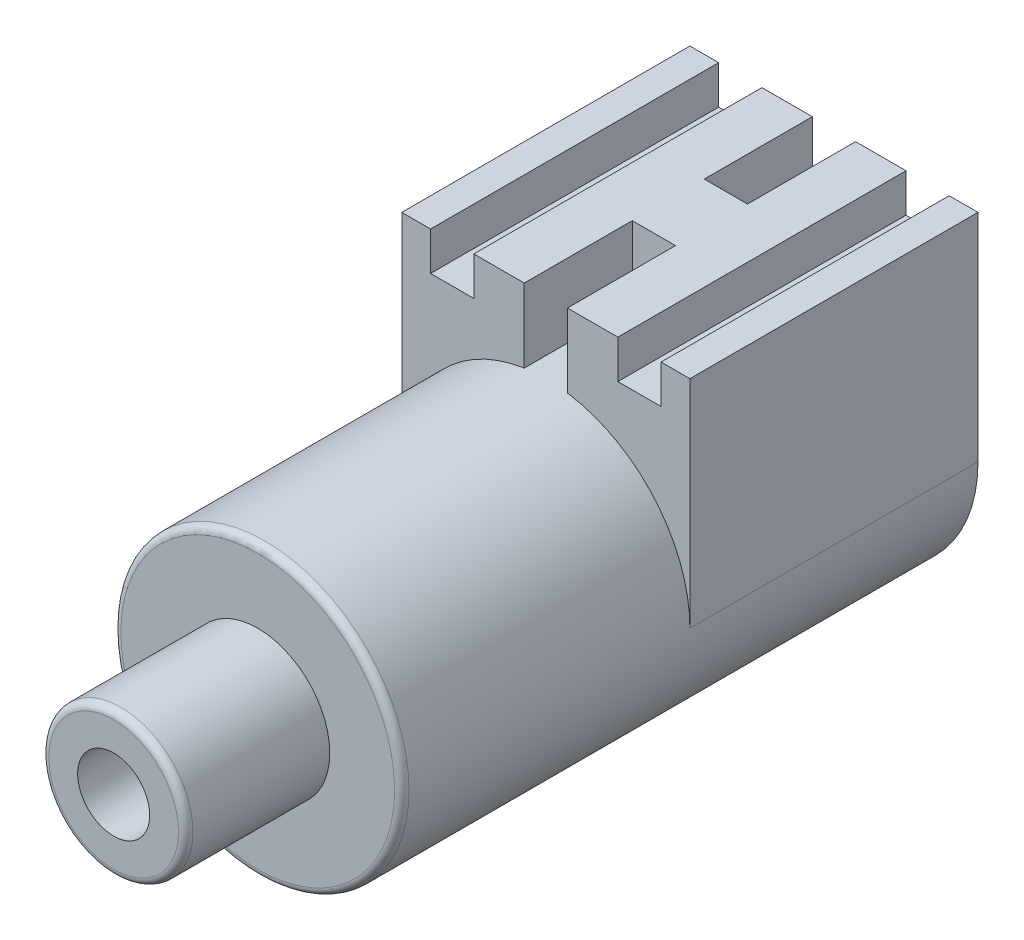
ISO-10303-21;
HEADER;
FILE_DESCRIPTION(('STEP AP214'),'2;1');
FILE_NAME('part.step','',(''),(''),'','','');
FILE_SCHEMA(('AUTOMOTIVE_DESIGN { 1 0 10303 214 1 1 1 1 }'));
ENDSEC;
DATA;
#1=APPLICATION_CONTEXT('core data for automotive mechanical design processes');
#2=APPLICATION_PROTOCOL_DEFINITION('international standard','automotive_design',2000,#1);
#3=PRODUCT_CONTEXT('',#1,'mechanical');
#4=PRODUCT('Part','Part','',(#3));
#5=PRODUCT_RELATED_PRODUCT_CATEGORY('part','',(#4));
#6=PRODUCT_DEFINITION_FORMATION('','',#4);
#7=PRODUCT_DEFINITION_CONTEXT('part definition',#1,'design');
#8=PRODUCT_DEFINITION('design','',#6,#7);
#9=PRODUCT_DEFINITION_SHAPE('','',#8);
#10=(LENGTH_UNIT() NAMED_UNIT(*) SI_UNIT(.MILLI.,.METRE.));
#11=(NAMED_UNIT(*) PLANE_ANGLE_UNIT() SI_UNIT($,.RADIAN.));
#12=(NAMED_UNIT(*) SI_UNIT($,.STERADIAN.) SOLID_ANGLE_UNIT());
#13=UNCERTAINTY_MEASURE_WITH_UNIT(LENGTH_MEASURE(1.E-05),#10,'distance_accuracy_value','');
#14=(GEOMETRIC_REPRESENTATION_CONTEXT(3) GLOBAL_UNCERTAINTY_ASSIGNED_CONTEXT((#13)) GLOBAL_UNIT_ASSIGNED_CONTEXT((#10,
#11,#12)) REPRESENTATION_CONTEXT('',''));
#15=CARTESIAN_POINT('',(0.,0.,0.));
#16=DIRECTION('',(0.,0.,1.));
#17=DIRECTION('',(1.,0.,0.));
#18=AXIS2_PLACEMENT_3D('',#15,#16,#17);
#19=CARTESIAN_POINT('',(0.,0.,-6.));
#20=DIRECTION('',(0.,0.,-1.));
#21=DIRECTION('',(-1.,0.,0.));
#22=AXIS2_PLACEMENT_3D('',#19,#20,#21);
#23=PLANE('',#22);
#24=CARTESIAN_POINT('',(0.,0.,-6.));
#25=DIRECTION('',(0.,0.,-1.));
#26=DIRECTION('',(-1.,0.,0.));
#27=AXIS2_PLACEMENT_3D('',#24,#25,#26);
#28=CIRCLE('',#27,2.);
#29=CARTESIAN_POINT('',(-2.,0.,-6.));
#30=VERTEX_POINT('',#29);
#31=CARTESIAN_POINT('',(-0.3,1.97737199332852,-6.));
#32=VERTEX_POINT('',#31);
#33=EDGE_CURVE('E192',#30,#32,#28,.T.);
#34=ORIENTED_EDGE('',*,*,#33,.T.);
#35=DIRECTION('',(0.,-1.,0.));
#36=VECTOR('',#35,1.);
#37=CARTESIAN_POINT('',(-0.3,3.,-6.));
#38=LINE('',#37,#36);
#39=CARTESIAN_POINT('',(-0.3,3.,-6.));
#40=VERTEX_POINT('',#39);
#41=EDGE_CURVE('E42',#40,#32,#38,.T.);
#42=ORIENTED_EDGE('',*,*,#41,.F.);
#43=DIRECTION('',(1.,0.,0.));
#44=VECTOR('',#43,1.);
#45=CARTESIAN_POINT('',(2.,3.,-6.));
#46=LINE('',#45,#44);
#47=CARTESIAN_POINT('',(-1.,3.,-6.));
#48=VERTEX_POINT('',#47);
#49=EDGE_CURVE('E362',#48,#40,#46,.T.);
#50=ORIENTED_EDGE('',*,*,#49,.F.);
#51=DIRECTION('',(0.,-1.,0.));
#52=VECTOR('',#51,1.);
#53=CARTESIAN_POINT('',(-1.,0.,-6.));
#54=LINE('',#53,#52);
#55=CARTESIAN_POINT('',(-1.,2.46520049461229,-6.));
#56=VERTEX_POINT('',#55);
#57=EDGE_CURVE('E244',#48,#56,#54,.T.);
#58=ORIENTED_EDGE('',*,*,#57,.T.);
#59=DIRECTION('',(-1.,0.,0.));
#60=VECTOR('',#59,1.);
#61=CARTESIAN_POINT('',(0.,2.46520049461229,-6.));
#62=LINE('',#61,#60);
#63=CARTESIAN_POINT('',(-1.6,2.46520049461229,-6.));
#64=VERTEX_POINT('',#63);
#65=EDGE_CURVE('E11',#56,#64,#62,.T.);
#66=ORIENTED_EDGE('',*,*,#65,.T.);
#67=DIRECTION('',(0.,1.,0.));
#68=VECTOR('',#67,1.);
#69=CARTESIAN_POINT('',(-1.6,0.,-6.));
#70=LINE('',#69,#68);
#71=CARTESIAN_POINT('',(-1.6,3.,-6.));
#72=VERTEX_POINT('',#71);
#73=EDGE_CURVE('E299',#64,#72,#70,.T.);
#74=ORIENTED_EDGE('',*,*,#73,.T.);
#75=CARTESIAN_POINT('',(-2.,3.,-6.));
#76=VERTEX_POINT('',#75);
#77=EDGE_CURVE('E357',#76,#72,#46,.T.);
#78=ORIENTED_EDGE('',*,*,#77,.F.);
#79=DIRECTION('',(0.,1.,0.));
#80=VECTOR('',#79,1.);
#81=CARTESIAN_POINT('',(-2.,3.,-6.));
#82=LINE('',#81,#80);
#83=EDGE_CURVE('E355',#30,#76,#82,.T.);
#84=ORIENTED_EDGE('',*,*,#83,.F.);
#85=EDGE_LOOP('',(#34,#42,#50,#58,#66,#74,#78,#84));
#86=FACE_BOUND('',#85,.T.);
#87=ADVANCED_FACE('F27',(#86),#23,.F.);
#88=CARTESIAN_POINT('',(2.,3.,-6.));
#89=DIRECTION('',(0.,1.,0.));
#90=DIRECTION('',(0.,0.,1.));
#91=AXIS2_PLACEMENT_3D('',#88,#89,#90);
#92=PLANE('',#91);
#93=DIRECTION('',(0.,0.,1.));
#94=VECTOR('',#93,1.);
#95=CARTESIAN_POINT('',(-0.3,3.,-7.5));
#96=LINE('',#95,#94);
#97=CARTESIAN_POINT('',(-0.3,3.,-7.5));
#98=VERTEX_POINT('',#97);
#99=EDGE_CURVE('E333',#98,#40,#96,.T.);
#100=ORIENTED_EDGE('',*,*,#99,.F.);
#101=DIRECTION('',(-1.,0.,0.));
#102=VECTOR('',#101,1.);
#103=CARTESIAN_POINT('',(-0.3,3.,-7.5));
#104=LINE('',#103,#102);
#105=CARTESIAN_POINT('',(0.3,3.,-7.5));
#106=VERTEX_POINT('',#105);
#107=EDGE_CURVE('E334',#106,#98,#104,.T.);
#108=ORIENTED_EDGE('',*,*,#107,.F.);
#109=DIRECTION('',(0.,0.,1.));
#110=VECTOR('',#109,1.);
#111=CARTESIAN_POINT('',(0.3,3.,-7.5));
#112=LINE('',#111,#110);
#113=CARTESIAN_POINT('',(0.3,3.,-6.));
#114=VERTEX_POINT('',#113);
#115=EDGE_CURVE('E174',#106,#114,#112,.T.);
#116=ORIENTED_EDGE('',*,*,#115,.T.);
#117=CARTESIAN_POINT('',(1.,3.,-6.));
#118=VERTEX_POINT('',#117);
#119=EDGE_CURVE('E184',#114,#118,#46,.T.);
#120=ORIENTED_EDGE('',*,*,#119,.T.);
#121=DIRECTION('',(0.,0.,1.));
#122=VECTOR('',#121,1.);
#123=CARTESIAN_POINT('',(1.,3.,-6.));
#124=LINE('',#123,#122);
#125=CARTESIAN_POINT('',(1.,3.,-10.));
#126=VERTEX_POINT('',#125);
#127=EDGE_CURVE('E226',#126,#118,#124,.T.);
#128=ORIENTED_EDGE('',*,*,#127,.F.);
#129=DIRECTION('',(1.,0.,0.));
#130=VECTOR('',#129,1.);
#131=CARTESIAN_POINT('',(2.,3.,-10.));
#132=LINE('',#131,#130);
#133=CARTESIAN_POINT('',(0.3,3.,-10.));
#134=VERTEX_POINT('',#133);
#135=EDGE_CURVE('E265',#134,#126,#132,.T.);
#136=ORIENTED_EDGE('',*,*,#135,.F.);
#137=DIRECTION('',(0.,0.,-1.));
#138=VECTOR('',#137,1.);
#139=CARTESIAN_POINT('',(0.3,3.,-8.5));
#140=LINE('',#139,#138);
#141=CARTESIAN_POINT('',(0.3,3.,-8.5));
#142=VERTEX_POINT('',#141);
#143=EDGE_CURVE('E257',#142,#134,#140,.T.);
#144=ORIENTED_EDGE('',*,*,#143,.F.);
#145=DIRECTION('',(1.,0.,0.));
#146=VECTOR('',#145,1.);
#147=CARTESIAN_POINT('',(0.3,3.,-8.5));
#148=LINE('',#147,#146);
#149=CARTESIAN_POINT('',(-0.3,3.,-8.5));
#150=VERTEX_POINT('',#149);
#151=EDGE_CURVE('E312',#150,#142,#148,.T.);
#152=ORIENTED_EDGE('',*,*,#151,.F.);
#153=DIRECTION('',(0.,0.,-1.));
#154=VECTOR('',#153,1.);
#155=CARTESIAN_POINT('',(-0.3,3.,-8.5));
#156=LINE('',#155,#154);
#157=CARTESIAN_POINT('',(-0.3,3.,-10.));
#158=VERTEX_POINT('',#157);
#159=EDGE_CURVE('E263',#150,#158,#156,.T.);
#160=ORIENTED_EDGE('',*,*,#159,.T.);
#161=CARTESIAN_POINT('',(-1.,3.,-10.));
#162=VERTEX_POINT('',#161);
#163=EDGE_CURVE('E253',#162,#158,#132,.T.);
#164=ORIENTED_EDGE('',*,*,#163,.F.);
#165=DIRECTION('',(0.,0.,-1.));
#166=VECTOR('',#165,1.);
#167=CARTESIAN_POINT('',(-1.,3.,-6.));
#168=LINE('',#167,#166);
#169=EDGE_CURVE('E35',#48,#162,#168,.T.);
#170=ORIENTED_EDGE('',*,*,#169,.F.);
#171=ORIENTED_EDGE('',*,*,#49,.T.);
#172=EDGE_LOOP('',(#100,#108,#116,#120,#128,#136,#144,#152,#160,#164,#170,#171));
#173=FACE_BOUND('',#172,.T.);
#174=ADVANCED_FACE('F261',(#173),#92,.T.);
#175=DIRECTION('',(0.,0.,-1.));
#176=VECTOR('',#175,1.);
#177=CARTESIAN_POINT('',(1.6,3.,-6.));
#178=LINE('',#177,#176);
#179=CARTESIAN_POINT('',(1.6,3.,-6.));
#180=VERTEX_POINT('',#179);
#181=CARTESIAN_POINT('',(1.6,3.,-10.));
#182=VERTEX_POINT('',#181);
#183=EDGE_CURVE('E229',#180,#182,#178,.T.);
#184=ORIENTED_EDGE('',*,*,#183,.F.);
#185=CARTESIAN_POINT('',(2.,3.,-6.));
#186=VERTEX_POINT('',#185);
#187=EDGE_CURVE('E359',#180,#186,#46,.T.);
#188=ORIENTED_EDGE('',*,*,#187,.T.);
#189=DIRECTION('',(0.,0.,-1.));
#190=VECTOR('',#189,1.);
#191=CARTESIAN_POINT('',(2.,3.,-6.));
#192=LINE('',#191,#190);
#193=CARTESIAN_POINT('',(2.,3.,-10.));
#194=VERTEX_POINT('',#193);
#195=EDGE_CURVE('E193',#186,#194,#192,.T.);
#196=ORIENTED_EDGE('',*,*,#195,.T.);
#197=EDGE_CURVE('E267',#182,#194,#132,.T.);
#198=ORIENTED_EDGE('',*,*,#197,.F.);
#199=EDGE_LOOP('',(#184,#188,#196,#198));
#200=FACE_BOUND('',#199,.T.);
#201=ADVANCED_FACE('F372',(#200),#92,.T.);
#202=CARTESIAN_POINT('',(0.,0.,-10.));
#203=DIRECTION('',(0.,0.,1.));
#204=DIRECTION('',(1.,0.,0.));
#205=AXIS2_PLACEMENT_3D('',#202,#203,#204);
#206=CYLINDRICAL_SURFACE('',#205,0.5);
#207=CARTESIAN_POINT('',(0.,0.,0.));
#208=DIRECTION('',(0.,0.,1.));
#209=DIRECTION('',(1.,0.,0.));
#210=AXIS2_PLACEMENT_3D('',#207,#208,#209);
#211=CIRCLE('',#210,0.5);
#212=CARTESIAN_POINT('',(0.5,0.,0.));
#213=VERTEX_POINT('',#212);
#214=EDGE_CURVE('E196',#213,#213,#211,.T.);
#215=ORIENTED_EDGE('',*,*,#214,.T.);
#216=EDGE_LOOP('',(#215));
#217=FACE_BOUND('',#216,.T.);
#218=CARTESIAN_POINT('',(0.,0.,-6.));
#219=DIRECTION('',(0.,0.,-1.));
#220=DIRECTION('',(-1.,0.,0.));
#221=AXIS2_PLACEMENT_3D('',#218,#219,#220);
#222=CIRCLE('',#221,0.5);
#223=CARTESIAN_POINT('',(-0.5,0.,-6.));
#224=VERTEX_POINT('',#223);
#225=EDGE_CURVE('E211',#224,#224,#222,.F.);
#226=ORIENTED_EDGE('',*,*,#225,.F.);
#227=EDGE_LOOP('',(#226));
#228=FACE_BOUND('',#227,.T.);
#229=ADVANCED_FACE('F427',(#217,#228),#206,.F.);
#230=CARTESIAN_POINT('',(0.,0.,-2.));
#231=DIRECTION('',(0.,0.,1.));
#232=DIRECTION('',(1.,0.,0.));
#233=AXIS2_PLACEMENT_3D('',#230,#231,#232);
#234=CYLINDRICAL_SURFACE('',#233,1.);
#235=CARTESIAN_POINT('',(0.,0.,-0.1));
#236=DIRECTION('',(0.,0.,1.));
#237=DIRECTION('',(1.,0.,0.));
#238=AXIS2_PLACEMENT_3D('',#235,#236,#237);
#239=CIRCLE('',#238,1.);
#240=CARTESIAN_POINT('',(1.,0.,-0.1));
#241=VERTEX_POINT('',#240);
#242=EDGE_CURVE('E223',#241,#241,#239,.F.);
#243=ORIENTED_EDGE('',*,*,#242,.T.);
#244=EDGE_LOOP('',(#243));
#245=FACE_BOUND('',#244,.T.);
#246=CARTESIAN_POINT('',(0.,0.,-2.));
#247=DIRECTION('',(0.,0.,-1.));
#248=DIRECTION('',(-1.,0.,0.));
#249=AXIS2_PLACEMENT_3D('',#246,#247,#248);
#250=CIRCLE('',#249,1.);
#251=CARTESIAN_POINT('',(-1.,0.,-2.));
#252=VERTEX_POINT('',#251);
#253=EDGE_CURVE('E208',#252,#252,#250,.F.);
#254=ORIENTED_EDGE('',*,*,#253,.T.);
#255=EDGE_LOOP('',(#254));
#256=FACE_BOUND('',#255,.T.);
#257=ADVANCED_FACE('F29',(#245,#256),#234,.T.);
#258=CARTESIAN_POINT('',(0.,0.,0.));
#259=DIRECTION('',(0.,0.,1.));
#260=DIRECTION('',(1.,0.,0.));
#261=AXIS2_PLACEMENT_3D('',#258,#259,#260);
#262=PLANE('',#261);
#263=CARTESIAN_POINT('',(0.,0.,0.));
#264=DIRECTION('',(0.,0.,1.));
#265=DIRECTION('',(1.,0.,0.));
#266=AXIS2_PLACEMENT_3D('',#263,#264,#265);
#267=CIRCLE('',#266,0.9);
#268=CARTESIAN_POINT('',(0.9,0.,0.));
#269=VERTEX_POINT('',#268);
#270=EDGE_CURVE('E220',#269,#269,#267,.T.);
#271=ORIENTED_EDGE('',*,*,#270,.T.);
#272=EDGE_LOOP('',(#271));
#273=FACE_BOUND('',#272,.T.);
#274=ORIENTED_EDGE('',*,*,#214,.F.);
#275=EDGE_LOOP('',(#274));
#276=FACE_BOUND('',#275,.T.);
#277=ADVANCED_FACE('F436',(#273,#276),#262,.T.);
#278=CARTESIAN_POINT('',(0.,0.,-10.));
#279=DIRECTION('',(0.,0.,1.));
#280=DIRECTION('',(1.,0.,0.));
#281=AXIS2_PLACEMENT_3D('',#278,#279,#280);
#282=CYLINDRICAL_SURFACE('',#281,2.);
#283=CARTESIAN_POINT('',(0.,0.,-2.1));
#284=DIRECTION('',(0.,0.,-1.));
#285=DIRECTION('',(-1.,0.,0.));
#286=AXIS2_PLACEMENT_3D('',#283,#284,#285);
#287=CIRCLE('',#286,2.);
#288=CARTESIAN_POINT('',(-2.,0.,-2.1));
#289=VERTEX_POINT('',#288);
#290=EDGE_CURVE('E214',#289,#289,#287,.T.);
#291=ORIENTED_EDGE('',*,*,#290,.T.);
#292=EDGE_LOOP('',(#291));
#293=FACE_BOUND('',#292,.T.);
#294=CARTESIAN_POINT('',(0.,0.,-10.));
#295=DIRECTION('',(0.,0.,-1.));
#296=DIRECTION('',(-1.,0.,0.));
#297=AXIS2_PLACEMENT_3D('',#294,#295,#296);
#298=CIRCLE('',#297,2.);
#299=CARTESIAN_POINT('',(2.,0.,-10.));
#300=VERTEX_POINT('',#299);
#301=CARTESIAN_POINT('',(-2.,0.,-10.));
#302=VERTEX_POINT('',#301);
#303=EDGE_CURVE('E205',#300,#302,#298,.T.);
#304=ORIENTED_EDGE('',*,*,#303,.F.);
#305=DIRECTION('',(0.,0.,-1.));
#306=VECTOR('',#305,1.);
#307=CARTESIAN_POINT('',(2.,0.,-6.));
#308=LINE('',#307,#306);
#309=CARTESIAN_POINT('',(2.,0.,-6.));
#310=VERTEX_POINT('',#309);
#311=EDGE_CURVE('E191',#310,#300,#308,.T.);
#312=ORIENTED_EDGE('',*,*,#311,.F.);
#313=CARTESIAN_POINT('',(0.3,1.97737199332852,-6.));
#314=VERTEX_POINT('',#313);
#315=EDGE_CURVE('E181',#314,#310,#28,.T.);
#316=ORIENTED_EDGE('',*,*,#315,.F.);
#317=DIRECTION('',(0.,0.,1.));
#318=VECTOR('',#317,1.);
#319=CARTESIAN_POINT('',(0.3,1.97737199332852,-7.5));
#320=LINE('',#319,#318);
#321=CARTESIAN_POINT('',(0.3,1.97737199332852,-7.5));
#322=VERTEX_POINT('',#321);
#323=EDGE_CURVE('E163',#322,#314,#320,.T.);
#324=ORIENTED_EDGE('',*,*,#323,.F.);
#325=CARTESIAN_POINT('',(0.,0.,-7.5));
#326=DIRECTION('',(0.,0.,-1.));
#327=DIRECTION('',(1.,0.,0.));
#328=AXIS2_PLACEMENT_3D('',#325,#326,#327);
#329=CIRCLE('',#328,2.);
#330=CARTESIAN_POINT('',(-0.3,1.97737199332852,-7.5));
#331=VERTEX_POINT('',#330);
#332=EDGE_CURVE('E341',#331,#322,#329,.T.);
#333=ORIENTED_EDGE('',*,*,#332,.F.);
#334=DIRECTION('',(0.,0.,1.));
#335=VECTOR('',#334,1.);
#336=CARTESIAN_POINT('',(-0.3,1.97737199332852,-7.5));
#337=LINE('',#336,#335);
#338=EDGE_CURVE('E175',#331,#32,#337,.T.);
#339=ORIENTED_EDGE('',*,*,#338,.T.);
#340=ORIENTED_EDGE('',*,*,#33,.F.);
#341=DIRECTION('',(0.,0.,-1.));
#342=VECTOR('',#341,1.);
#343=CARTESIAN_POINT('',(-2.,0.,-6.));
#344=LINE('',#343,#342);
#345=EDGE_CURVE('E364',#30,#302,#344,.T.);
#346=ORIENTED_EDGE('',*,*,#345,.T.);
#347=EDGE_LOOP('',(#304,#312,#316,#324,#333,#339,#340,#346));
#348=FACE_BOUND('',#347,.T.);
#349=ADVANCED_FACE('F189',(#293,#348),#282,.T.);
#350=CARTESIAN_POINT('',(0.,0.,-10.));
#351=DIRECTION('',(0.,0.,-1.));
#352=DIRECTION('',(-1.,0.,0.));
#353=AXIS2_PLACEMENT_3D('',#350,#351,#352);
#354=PLANE('',#353);
#355=DIRECTION('',(0.,-1.,0.));
#356=VECTOR('',#355,1.);
#357=CARTESIAN_POINT('',(0.3,3.,-10.));
#358=LINE('',#357,#356);
#359=CARTESIAN_POINT('',(0.3,1.97737199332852,-10.));
#360=VERTEX_POINT('',#359);
#361=EDGE_CURVE('E50',#134,#360,#358,.T.);
#362=ORIENTED_EDGE('',*,*,#361,.F.);
#363=ORIENTED_EDGE('',*,*,#135,.T.);
#364=DIRECTION('',(0.,1.,0.));
#365=VECTOR('',#364,1.);
#366=CARTESIAN_POINT('',(1.,3.,-10.));
#367=LINE('',#366,#365);
#368=CARTESIAN_POINT('',(1.,2.46520049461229,-10.));
#369=VERTEX_POINT('',#368);
#370=EDGE_CURVE('E288',#369,#126,#367,.T.);
#371=ORIENTED_EDGE('',*,*,#370,.F.);
#372=DIRECTION('',(-1.,0.,0.));
#373=VECTOR('',#372,1.);
#374=CARTESIAN_POINT('',(1.6,2.46520049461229,-10.));
#375=LINE('',#374,#373);
#376=CARTESIAN_POINT('',(1.6,2.46520049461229,-10.));
#377=VERTEX_POINT('',#376);
#378=EDGE_CURVE('E292',#377,#369,#375,.T.);
#379=ORIENTED_EDGE('',*,*,#378,.F.);
#380=DIRECTION('',(0.,-1.,0.));
#381=VECTOR('',#380,1.);
#382=CARTESIAN_POINT('',(1.6,3.,-10.));
#383=LINE('',#382,#381);
#384=EDGE_CURVE('E295',#182,#377,#383,.T.);
#385=ORIENTED_EDGE('',*,*,#384,.F.);
#386=ORIENTED_EDGE('',*,*,#197,.T.);
#387=DIRECTION('',(0.,-1.,0.));
#388=VECTOR('',#387,1.);
#389=CARTESIAN_POINT('',(2.,3.,-10.));
#390=LINE('',#389,#388);
#391=EDGE_CURVE('E276',#194,#300,#390,.T.);
#392=ORIENTED_EDGE('',*,*,#391,.T.);
#393=ORIENTED_EDGE('',*,*,#303,.T.);
#394=DIRECTION('',(0.,1.,0.));
#395=VECTOR('',#394,1.);
#396=CARTESIAN_POINT('',(-2.,3.,-10.));
#397=LINE('',#396,#395);
#398=CARTESIAN_POINT('',(-2.,3.,-10.));
#399=VERTEX_POINT('',#398);
#400=EDGE_CURVE('E272',#302,#399,#397,.T.);
#401=ORIENTED_EDGE('',*,*,#400,.T.);
#402=CARTESIAN_POINT('',(-1.6,3.,-10.));
#403=VERTEX_POINT('',#402);
#404=EDGE_CURVE('E264',#399,#403,#132,.T.);
#405=ORIENTED_EDGE('',*,*,#404,.T.);
#406=DIRECTION('',(0.,1.,0.));
#407=VECTOR('',#406,1.);
#408=CARTESIAN_POINT('',(-1.6,3.,-10.));
#409=LINE('',#408,#407);
#410=CARTESIAN_POINT('',(-1.6,2.46520049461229,-10.));
#411=VERTEX_POINT('',#410);
#412=EDGE_CURVE('E305',#411,#403,#409,.T.);
#413=ORIENTED_EDGE('',*,*,#412,.F.);
#414=DIRECTION('',(-1.,0.,0.));
#415=VECTOR('',#414,1.);
#416=CARTESIAN_POINT('',(-1.,2.46520049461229,-10.));
#417=LINE('',#416,#415);
#418=CARTESIAN_POINT('',(-1.,2.46520049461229,-10.));
#419=VERTEX_POINT('',#418);
#420=EDGE_CURVE('E256',#419,#411,#417,.T.);
#421=ORIENTED_EDGE('',*,*,#420,.F.);
#422=DIRECTION('',(0.,-1.,0.));
#423=VECTOR('',#422,1.);
#424=CARTESIAN_POINT('',(-1.,3.,-10.));
#425=LINE('',#424,#423);
#426=EDGE_CURVE('E241',#162,#419,#425,.T.);
#427=ORIENTED_EDGE('',*,*,#426,.F.);
#428=ORIENTED_EDGE('',*,*,#163,.T.);
#429=DIRECTION('',(0.,1.,0.));
#430=VECTOR('',#429,1.);
#431=CARTESIAN_POINT('',(-0.3,3.,-10.));
#432=LINE('',#431,#430);
#433=CARTESIAN_POINT('',(-0.3,1.97737199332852,-10.));
#434=VERTEX_POINT('',#433);
#435=EDGE_CURVE('E327',#434,#158,#432,.T.);
#436=ORIENTED_EDGE('',*,*,#435,.F.);
#437=CARTESIAN_POINT('',(0.,0.,-10.));
#438=DIRECTION('',(0.,0.,1.));
#439=DIRECTION('',(-1.,0.,0.));
#440=AXIS2_PLACEMENT_3D('',#437,#438,#439);
#441=CIRCLE('',#440,2.);
#442=EDGE_CURVE('E329',#360,#434,#441,.T.);
#443=ORIENTED_EDGE('',*,*,#442,.F.);
#444=EDGE_LOOP('',(#362,#363,#371,#379,#385,#386,#392,#393,#401,#405,#413,#421,#427,#428,#436,#443));
#445=FACE_BOUND('',#444,.T.);
#446=ADVANCED_FACE('F251',(#445),#354,.T.);
#447=CARTESIAN_POINT('',(0.,0.,-2.));
#448=DIRECTION('',(0.,0.,-1.));
#449=DIRECTION('',(-1.,0.,0.));
#450=AXIS2_PLACEMENT_3D('',#447,#448,#449);
#451=PLANE('',#450);
#452=CARTESIAN_POINT('',(0.,0.,-2.));
#453=DIRECTION('',(0.,0.,-1.));
#454=DIRECTION('',(-1.,0.,0.));
#455=AXIS2_PLACEMENT_3D('',#452,#453,#454);
#456=CIRCLE('',#455,1.9);
#457=CARTESIAN_POINT('',(-1.9,0.,-2.));
#458=VERTEX_POINT('',#457);
#459=EDGE_CURVE('E217',#458,#458,#456,.F.);
#460=ORIENTED_EDGE('',*,*,#459,.T.);
#461=EDGE_LOOP('',(#460));
#462=FACE_BOUND('',#461,.T.);
#463=ORIENTED_EDGE('',*,*,#253,.F.);
#464=EDGE_LOOP('',(#463));
#465=FACE_BOUND('',#464,.T.);
#466=ADVANCED_FACE('F417',(#462,#465),#451,.F.);
#467=ORIENTED_EDGE('',*,*,#225,.T.);
#468=EDGE_LOOP('',(#467));
#469=FACE_BOUND('',#468,.T.);
#470=ADVANCED_FACE('F411',(#469),#23,.F.);
#471=ORIENTED_EDGE('',*,*,#119,.F.);
#472=DIRECTION('',(0.,1.,0.));
#473=VECTOR('',#472,1.);
#474=CARTESIAN_POINT('',(0.3,3.,-6.));
#475=LINE('',#474,#473);
#476=EDGE_CURVE('E166',#314,#114,#475,.T.);
#477=ORIENTED_EDGE('',*,*,#476,.F.);
#478=ORIENTED_EDGE('',*,*,#315,.T.);
#479=DIRECTION('',(0.,-1.,0.));
#480=VECTOR('',#479,1.);
#481=CARTESIAN_POINT('',(2.,3.,-6.));
#482=LINE('',#481,#480);
#483=EDGE_CURVE('E269',#186,#310,#482,.T.);
#484=ORIENTED_EDGE('',*,*,#483,.F.);
#485=ORIENTED_EDGE('',*,*,#187,.F.);
#486=DIRECTION('',(0.,-1.,0.));
#487=VECTOR('',#486,1.);
#488=CARTESIAN_POINT('',(1.6,0.,-6.));
#489=LINE('',#488,#487);
#490=CARTESIAN_POINT('',(1.6,2.46520049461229,-6.));
#491=VERTEX_POINT('',#490);
#492=EDGE_CURVE('E278',#180,#491,#489,.T.);
#493=ORIENTED_EDGE('',*,*,#492,.T.);
#494=DIRECTION('',(-1.,0.,0.));
#495=VECTOR('',#494,1.);
#496=CARTESIAN_POINT('',(0.,2.46520049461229,-6.));
#497=LINE('',#496,#495);
#498=CARTESIAN_POINT('',(1.,2.46520049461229,-6.));
#499=VERTEX_POINT('',#498);
#500=EDGE_CURVE('E231',#491,#499,#497,.T.);
#501=ORIENTED_EDGE('',*,*,#500,.T.);
#502=DIRECTION('',(0.,1.,0.));
#503=VECTOR('',#502,1.);
#504=CARTESIAN_POINT('',(1.,0.,-6.));
#505=LINE('',#504,#503);
#506=EDGE_CURVE('E283',#499,#118,#505,.T.);
#507=ORIENTED_EDGE('',*,*,#506,.T.);
#508=EDGE_LOOP('',(#471,#477,#478,#484,#485,#493,#501,#507));
#509=FACE_BOUND('',#508,.T.);
#510=ADVANCED_FACE('F179',(#509),#23,.F.);
#511=CARTESIAN_POINT('',(2.,3.,-6.));
#512=DIRECTION('',(1.,0.,0.));
#513=DIRECTION('',(0.,1.,0.));
#514=AXIS2_PLACEMENT_3D('',#511,#512,#513);
#515=PLANE('',#514);
#516=ORIENTED_EDGE('',*,*,#391,.F.);
#517=ORIENTED_EDGE('',*,*,#195,.F.);
#518=ORIENTED_EDGE('',*,*,#483,.T.);
#519=ORIENTED_EDGE('',*,*,#311,.T.);
#520=EDGE_LOOP('',(#516,#517,#518,#519));
#521=FACE_BOUND('',#520,.T.);
#522=ADVANCED_FACE('F367',(#521),#515,.T.);
#523=DIRECTION('',(0.,0.,1.));
#524=VECTOR('',#523,1.);
#525=CARTESIAN_POINT('',(-1.6,3.,-6.));
#526=LINE('',#525,#524);
#527=EDGE_CURVE('E234',#403,#72,#526,.T.);
#528=ORIENTED_EDGE('',*,*,#527,.F.);
#529=ORIENTED_EDGE('',*,*,#404,.F.);
#530=DIRECTION('',(0.,0.,-1.));
#531=VECTOR('',#530,1.);
#532=CARTESIAN_POINT('',(-2.,3.,-6.));
#533=LINE('',#532,#531);
#534=EDGE_CURVE('E198',#76,#399,#533,.T.);
#535=ORIENTED_EDGE('',*,*,#534,.F.);
#536=ORIENTED_EDGE('',*,*,#77,.T.);
#537=EDGE_LOOP('',(#528,#529,#535,#536));
#538=FACE_BOUND('',#537,.T.);
#539=ADVANCED_FACE('F393',(#538),#92,.T.);
#540=CARTESIAN_POINT('',(-2.,3.,-6.));
#541=DIRECTION('',(-1.,0.,0.));
#542=DIRECTION('',(0.,0.,1.));
#543=AXIS2_PLACEMENT_3D('',#540,#541,#542);
#544=PLANE('',#543);
#545=ORIENTED_EDGE('',*,*,#400,.F.);
#546=ORIENTED_EDGE('',*,*,#345,.F.);
#547=ORIENTED_EDGE('',*,*,#83,.T.);
#548=ORIENTED_EDGE('',*,*,#534,.T.);
#549=EDGE_LOOP('',(#545,#546,#547,#548));
#550=FACE_BOUND('',#549,.T.);
#551=ADVANCED_FACE('F394',(#550),#544,.T.);
#552=CARTESIAN_POINT('',(0.,0.,-2.1));
#553=DIRECTION('',(0.,0.,-1.));
#554=DIRECTION('',(-1.,0.,0.));
#555=AXIS2_PLACEMENT_3D('',#552,#553,#554);
#556=TOROIDAL_SURFACE('',#555,1.9,0.1);
#557=ORIENTED_EDGE('',*,*,#459,.F.);
#558=EDGE_LOOP('',(#557));
#559=FACE_BOUND('',#558,.T.);
#560=ORIENTED_EDGE('',*,*,#290,.F.);
#561=EDGE_LOOP('',(#560));
#562=FACE_BOUND('',#561,.T.);
#563=ADVANCED_FACE('F396',(#559,#562),#556,.T.);
#564=CARTESIAN_POINT('',(0.,0.,-0.1));
#565=DIRECTION('',(0.,0.,1.));
#566=DIRECTION('',(1.,0.,0.));
#567=AXIS2_PLACEMENT_3D('',#564,#565,#566);
#568=TOROIDAL_SURFACE('',#567,0.9,0.1);
#569=ORIENTED_EDGE('',*,*,#242,.F.);
#570=EDGE_LOOP('',(#569));
#571=FACE_BOUND('',#570,.T.);
#572=ORIENTED_EDGE('',*,*,#270,.F.);
#573=EDGE_LOOP('',(#572));
#574=FACE_BOUND('',#573,.T.);
#575=ADVANCED_FACE('F403',(#571,#574),#568,.T.);
#576=CARTESIAN_POINT('',(1.6,2.46520049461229,0.));
#577=DIRECTION('',(0.,-1.,0.));
#578=DIRECTION('',(1.,0.,0.));
#579=AXIS2_PLACEMENT_3D('',#576,#577,#578);
#580=PLANE('',#579);
#581=DIRECTION('',(0.,0.,-1.));
#582=VECTOR('',#581,1.);
#583=CARTESIAN_POINT('',(1.6,2.46520049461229,0.));
#584=LINE('',#583,#582);
#585=EDGE_CURVE('E286',#491,#377,#584,.T.);
#586=ORIENTED_EDGE('',*,*,#585,.T.);
#587=ORIENTED_EDGE('',*,*,#378,.T.);
#588=DIRECTION('',(0.,0.,-1.));
#589=VECTOR('',#588,1.);
#590=CARTESIAN_POINT('',(1.,2.46520049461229,0.));
#591=LINE('',#590,#589);
#592=EDGE_CURVE('E285',#499,#369,#591,.T.);
#593=ORIENTED_EDGE('',*,*,#592,.F.);
#594=ORIENTED_EDGE('',*,*,#500,.F.);
#595=EDGE_LOOP('',(#586,#587,#593,#594));
#596=FACE_BOUND('',#595,.T.);
#597=ADVANCED_FACE('F380',(#596),#580,.F.);
#598=CARTESIAN_POINT('',(1.6,3.,0.));
#599=DIRECTION('',(1.,0.,0.));
#600=DIRECTION('',(0.,0.,-1.));
#601=AXIS2_PLACEMENT_3D('',#598,#599,#600);
#602=PLANE('',#601);
#603=ORIENTED_EDGE('',*,*,#183,.T.);
#604=ORIENTED_EDGE('',*,*,#384,.T.);
#605=ORIENTED_EDGE('',*,*,#585,.F.);
#606=ORIENTED_EDGE('',*,*,#492,.F.);
#607=EDGE_LOOP('',(#603,#604,#605,#606));
#608=FACE_BOUND('',#607,.T.);
#609=ADVANCED_FACE('F374',(#608),#602,.F.);
#610=CARTESIAN_POINT('',(1.,3.,0.));
#611=DIRECTION('',(-1.,0.,0.));
#612=DIRECTION('',(0.,0.,1.));
#613=AXIS2_PLACEMENT_3D('',#610,#611,#612);
#614=PLANE('',#613);
#615=ORIENTED_EDGE('',*,*,#592,.T.);
#616=ORIENTED_EDGE('',*,*,#370,.T.);
#617=ORIENTED_EDGE('',*,*,#127,.T.);
#618=ORIENTED_EDGE('',*,*,#506,.F.);
#619=EDGE_LOOP('',(#615,#616,#617,#618));
#620=FACE_BOUND('',#619,.T.);
#621=ADVANCED_FACE('F382',(#620),#614,.F.);
#622=CARTESIAN_POINT('',(-1.,2.46520049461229,0.));
#623=DIRECTION('',(0.,-1.,0.));
#624=DIRECTION('',(0.,0.,-1.));
#625=AXIS2_PLACEMENT_3D('',#622,#623,#624);
#626=PLANE('',#625);
#627=DIRECTION('',(0.,0.,-1.));
#628=VECTOR('',#627,1.);
#629=CARTESIAN_POINT('',(-1.,2.46520049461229,0.));
#630=LINE('',#629,#628);
#631=EDGE_CURVE('E303',#56,#419,#630,.T.);
#632=ORIENTED_EDGE('',*,*,#631,.T.);
#633=ORIENTED_EDGE('',*,*,#420,.T.);
#634=DIRECTION('',(0.,0.,-1.));
#635=VECTOR('',#634,1.);
#636=CARTESIAN_POINT('',(-1.6,2.46520049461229,0.));
#637=LINE('',#636,#635);
#638=EDGE_CURVE('E302',#64,#411,#637,.T.);
#639=ORIENTED_EDGE('',*,*,#638,.F.);
#640=ORIENTED_EDGE('',*,*,#65,.F.);
#641=EDGE_LOOP('',(#632,#633,#639,#640));
#642=FACE_BOUND('',#641,.T.);
#643=ADVANCED_FACE('F388',(#642),#626,.F.);
#644=CARTESIAN_POINT('',(-1.,3.,0.));
#645=DIRECTION('',(1.,0.,0.));
#646=DIRECTION('',(0.,0.,-1.));
#647=AXIS2_PLACEMENT_3D('',#644,#645,#646);
#648=PLANE('',#647);
#649=ORIENTED_EDGE('',*,*,#169,.T.);
#650=ORIENTED_EDGE('',*,*,#426,.T.);
#651=ORIENTED_EDGE('',*,*,#631,.F.);
#652=ORIENTED_EDGE('',*,*,#57,.F.);
#653=EDGE_LOOP('',(#649,#650,#651,#652));
#654=FACE_BOUND('',#653,.T.);
#655=ADVANCED_FACE('F239',(#654),#648,.F.);
#656=CARTESIAN_POINT('',(-1.6,3.,0.));
#657=DIRECTION('',(-1.,0.,0.));
#658=DIRECTION('',(0.,-1.,0.));
#659=AXIS2_PLACEMENT_3D('',#656,#657,#658);
#660=PLANE('',#659);
#661=ORIENTED_EDGE('',*,*,#638,.T.);
#662=ORIENTED_EDGE('',*,*,#412,.T.);
#663=ORIENTED_EDGE('',*,*,#527,.T.);
#664=ORIENTED_EDGE('',*,*,#73,.F.);
#665=EDGE_LOOP('',(#661,#662,#663,#664));
#666=FACE_BOUND('',#665,.T.);
#667=ADVANCED_FACE('F390',(#666),#660,.F.);
#668=CARTESIAN_POINT('',(0.3,3.,-8.5));
#669=DIRECTION('',(1.,0.,0.));
#670=DIRECTION('',(0.,1.,0.));
#671=AXIS2_PLACEMENT_3D('',#668,#669,#670);
#672=PLANE('',#671);
#673=ORIENTED_EDGE('',*,*,#361,.T.);
#674=DIRECTION('',(0.,0.,-1.));
#675=VECTOR('',#674,1.);
#676=CARTESIAN_POINT('',(0.3,1.97737199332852,-8.5));
#677=LINE('',#676,#675);
#678=CARTESIAN_POINT('',(0.3,1.97737199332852,-8.5));
#679=VERTEX_POINT('',#678);
#680=EDGE_CURVE('E309',#679,#360,#677,.T.);
#681=ORIENTED_EDGE('',*,*,#680,.F.);
#682=DIRECTION('',(0.,-1.,0.));
#683=VECTOR('',#682,1.);
#684=CARTESIAN_POINT('',(0.3,3.,-8.5));
#685=LINE('',#684,#683);
#686=EDGE_CURVE('E324',#142,#679,#685,.T.);
#687=ORIENTED_EDGE('',*,*,#686,.F.);
#688=ORIENTED_EDGE('',*,*,#143,.T.);
#689=EDGE_LOOP('',(#673,#681,#687,#688));
#690=FACE_BOUND('',#689,.T.);
#691=ADVANCED_FACE('F469',(#690),#672,.F.);
#692=CARTESIAN_POINT('',(-0.3,3.,-8.5));
#693=DIRECTION('',(-1.,0.,0.));
#694=DIRECTION('',(0.,-1.,0.));
#695=AXIS2_PLACEMENT_3D('',#692,#693,#694);
#696=PLANE('',#695);
#697=ORIENTED_EDGE('',*,*,#435,.T.);
#698=ORIENTED_EDGE('',*,*,#159,.F.);
#699=DIRECTION('',(0.,1.,0.));
#700=VECTOR('',#699,1.);
#701=CARTESIAN_POINT('',(-0.3,3.,-8.5));
#702=LINE('',#701,#700);
#703=CARTESIAN_POINT('',(-0.3,1.97737199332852,-8.5));
#704=VERTEX_POINT('',#703);
#705=EDGE_CURVE('E318',#704,#150,#702,.T.);
#706=ORIENTED_EDGE('',*,*,#705,.F.);
#707=DIRECTION('',(0.,0.,-1.));
#708=VECTOR('',#707,1.);
#709=CARTESIAN_POINT('',(-0.3,1.97737199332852,-8.5));
#710=LINE('',#709,#708);
#711=EDGE_CURVE('E311',#704,#434,#710,.T.);
#712=ORIENTED_EDGE('',*,*,#711,.T.);
#713=EDGE_LOOP('',(#697,#698,#706,#712));
#714=FACE_BOUND('',#713,.T.);
#715=ADVANCED_FACE('F472',(#714),#696,.F.);
#716=CARTESIAN_POINT('',(0.,0.,-8.5));
#717=DIRECTION('',(0.,0.,-1.));
#718=DIRECTION('',(-1.,0.,0.));
#719=AXIS2_PLACEMENT_3D('',#716,#717,#718);
#720=CYLINDRICAL_SURFACE('',#719,2.);
#721=ORIENTED_EDGE('',*,*,#442,.T.);
#722=ORIENTED_EDGE('',*,*,#711,.F.);
#723=CARTESIAN_POINT('',(0.,0.,-8.5));
#724=DIRECTION('',(0.,0.,1.));
#725=DIRECTION('',(-1.,0.,0.));
#726=AXIS2_PLACEMENT_3D('',#723,#724,#725);
#727=CIRCLE('',#726,2.);
#728=EDGE_CURVE('E321',#679,#704,#727,.T.);
#729=ORIENTED_EDGE('',*,*,#728,.F.);
#730=ORIENTED_EDGE('',*,*,#680,.T.);
#731=EDGE_LOOP('',(#721,#722,#729,#730));
#732=FACE_BOUND('',#731,.T.);
#733=ADVANCED_FACE('F473',(#732),#720,.T.);
#734=CARTESIAN_POINT('',(0.,0.,-8.5));
#735=DIRECTION('',(0.,0.,-1.));
#736=DIRECTION('',(-1.,0.,0.));
#737=AXIS2_PLACEMENT_3D('',#734,#735,#736);
#738=PLANE('',#737);
#739=ORIENTED_EDGE('',*,*,#686,.T.);
#740=ORIENTED_EDGE('',*,*,#728,.T.);
#741=ORIENTED_EDGE('',*,*,#705,.T.);
#742=ORIENTED_EDGE('',*,*,#151,.T.);
#743=EDGE_LOOP('',(#739,#740,#741,#742));
#744=FACE_BOUND('',#743,.T.);
#745=ADVANCED_FACE('F476',(#744),#738,.T.);
#746=CARTESIAN_POINT('',(-0.3,3.,-7.5));
#747=DIRECTION('',(-1.,0.,0.));
#748=DIRECTION('',(0.,-1.,0.));
#749=AXIS2_PLACEMENT_3D('',#746,#747,#748);
#750=PLANE('',#749);
#751=ORIENTED_EDGE('',*,*,#41,.T.);
#752=ORIENTED_EDGE('',*,*,#338,.F.);
#753=DIRECTION('',(0.,-1.,0.));
#754=VECTOR('',#753,1.);
#755=CARTESIAN_POINT('',(-0.3,3.,-7.5));
#756=LINE('',#755,#754);
#757=EDGE_CURVE('E185',#98,#331,#756,.T.);
#758=ORIENTED_EDGE('',*,*,#757,.F.);
#759=ORIENTED_EDGE('',*,*,#99,.T.);
#760=EDGE_LOOP('',(#751,#752,#758,#759));
#761=FACE_BOUND('',#760,.T.);
#762=ADVANCED_FACE('F348',(#761),#750,.F.);
#763=CARTESIAN_POINT('',(0.3,3.,-7.5));
#764=DIRECTION('',(1.,0.,0.));
#765=DIRECTION('',(0.,0.,-1.));
#766=AXIS2_PLACEMENT_3D('',#763,#764,#765);
#767=PLANE('',#766);
#768=ORIENTED_EDGE('',*,*,#476,.T.);
#769=ORIENTED_EDGE('',*,*,#115,.F.);
#770=DIRECTION('',(0.,1.,0.));
#771=VECTOR('',#770,1.);
#772=CARTESIAN_POINT('',(0.3,3.,-7.5));
#773=LINE('',#772,#771);
#774=EDGE_CURVE('E169',#322,#106,#773,.T.);
#775=ORIENTED_EDGE('',*,*,#774,.F.);
#776=ORIENTED_EDGE('',*,*,#323,.T.);
#777=EDGE_LOOP('',(#768,#769,#775,#776));
#778=FACE_BOUND('',#777,.T.);
#779=ADVANCED_FACE('F165',(#778),#767,.F.);
#780=CARTESIAN_POINT('',(0.,0.,-7.5));
#781=DIRECTION('',(0.,0.,1.));
#782=DIRECTION('',(1.,0.,0.));
#783=AXIS2_PLACEMENT_3D('',#780,#781,#782);
#784=PLANE('',#783);
#785=ORIENTED_EDGE('',*,*,#757,.T.);
#786=ORIENTED_EDGE('',*,*,#332,.T.);
#787=ORIENTED_EDGE('',*,*,#774,.T.);
#788=ORIENTED_EDGE('',*,*,#107,.T.);
#789=EDGE_LOOP('',(#785,#786,#787,#788));
#790=FACE_BOUND('',#789,.T.);
#791=ADVANCED_FACE('F346',(#790),#784,.T.);
#792=CLOSED_SHELL('',(#87,#174,#201,#229,#257,#277,#349,#446,#466,#470,#510,#522,#539,#551,#563,
#575,#597,#609,#621,#643,#655,#667,#691,#715,#733,#745,#762,#779,#791));
#793=MANIFOLD_SOLID_BREP('B2',#792);
#794=ADVANCED_BREP_SHAPE_REPRESENTATION('',(#18,#793),#14);
#795=SHAPE_DEFINITION_REPRESENTATION(#9,#794);
ENDSEC;
END-ISO-10303-21;
